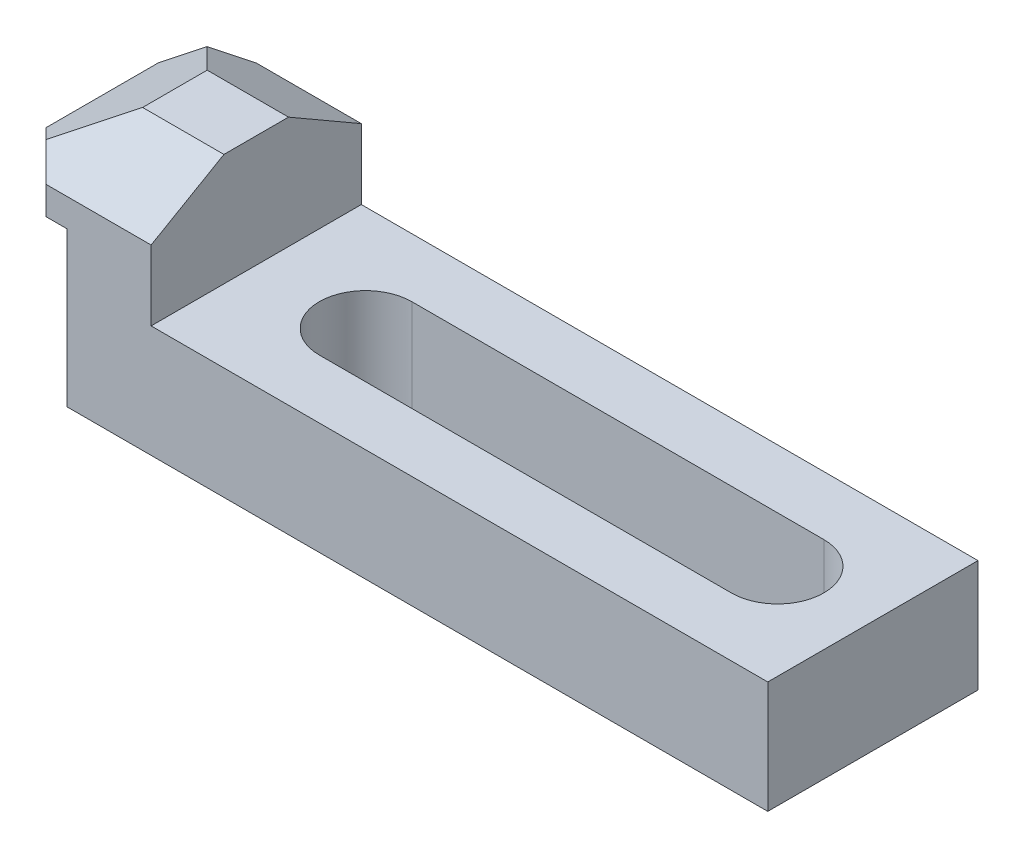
from build123d import *
from OCP.BRepFilletAPI import BRepFilletAPI_MakeChamfer

# Parameters (mm, degrees)
EXTRUDE1_DEPTH = 7.5
CHAMFER1_SIZE  = 3
CHAMFER1_SIZE2 = 5.196152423
EXTRUDE2_DEPTH = 58.768936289


with BuildPart() as part:
    # Sketch1 → Extrude1 (new, symmetric)
    with BuildSketch(Plane.XY):
        Polygon((0, 0), (5, 0), (5, -11), (55, -11), (55, -3), (11, -3), (11, 5), (0, 5), align=None)
    extrude(amount=EXTRUDE1_DEPTH, both=True)

    # Chamfer1: one chamfer whose edges measure the first distance from different faces: ONE call of the kernel's chamfer builder (chamfer() names one face for all edges)
    chamfer1_edges_1 = [part.edges().sort_by_distance(p)[0] for p in [
        (0, 5, 0),
    ]]
    chamfer1_side_1 = [part.faces().sort_by_distance(p)[0] for p in [
        (0, 2.5, 0),
    ]]
    chamfer1_edges_2 = [part.edges().sort_by_distance(p)[0] for p in [
        (5.5, 5, 7.5),
    ]]
    chamfer1_side_2 = [part.faces().sort_by_distance(p)[0] for p in [
        (26.313953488, -5.686046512, 7.5),
    ]]
    chamfer1_edges_3 = [part.edges().sort_by_distance(p)[0] for p in [
        (5.5, 5, -7.5),
    ]]
    chamfer1_side_3 = [part.faces().sort_by_distance(p)[0] for p in [
        (26.313953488, -5.686046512, -7.5),
    ]]
    chamfer1 = BRepFilletAPI_MakeChamfer(part.part.solid().wrapped)
    for e in chamfer1_edges_1:
        chamfer1.Add(CHAMFER1_SIZE, CHAMFER1_SIZE2, e.wrapped, chamfer1_side_1[0].wrapped)  # the first distance lies on this face
    for e in chamfer1_edges_2:
        chamfer1.Add(CHAMFER1_SIZE, CHAMFER1_SIZE2, e.wrapped, chamfer1_side_2[0].wrapped)  # the first distance lies on this face
    for e in chamfer1_edges_3:
        chamfer1.Add(CHAMFER1_SIZE, CHAMFER1_SIZE2, e.wrapped, chamfer1_side_3[0].wrapped)  # the first distance lies on this face
    add(Compound.cast(chamfer1.Shape()), mode=Mode.REPLACE)

    # Sketch2 → Extrude2 (cut, through all)
    with BuildSketch(Plane.XZ.offset(11)):
        with BuildLine():
            Line((18.8, 3.3), (48.2, 3.3))
            ThreePointArc((48.2, 3.3), (51.5, 0), (48.2, -3.3))
            Line((48.2, -3.3), (18.8, -3.3))
            ThreePointArc((18.8, -3.3), (15.5, 0), (18.8, 3.3))
        make_face()
        Polygon((0, 7.5), (3.5, 7.5), (0, 4), align=None)
        Polygon((0, -4), (0, -7.5), (3.5, -7.5), align=None)
    extrude(amount=-EXTRUDE2_DEPTH, mode=Mode.SUBTRACT)


solid = part.part
